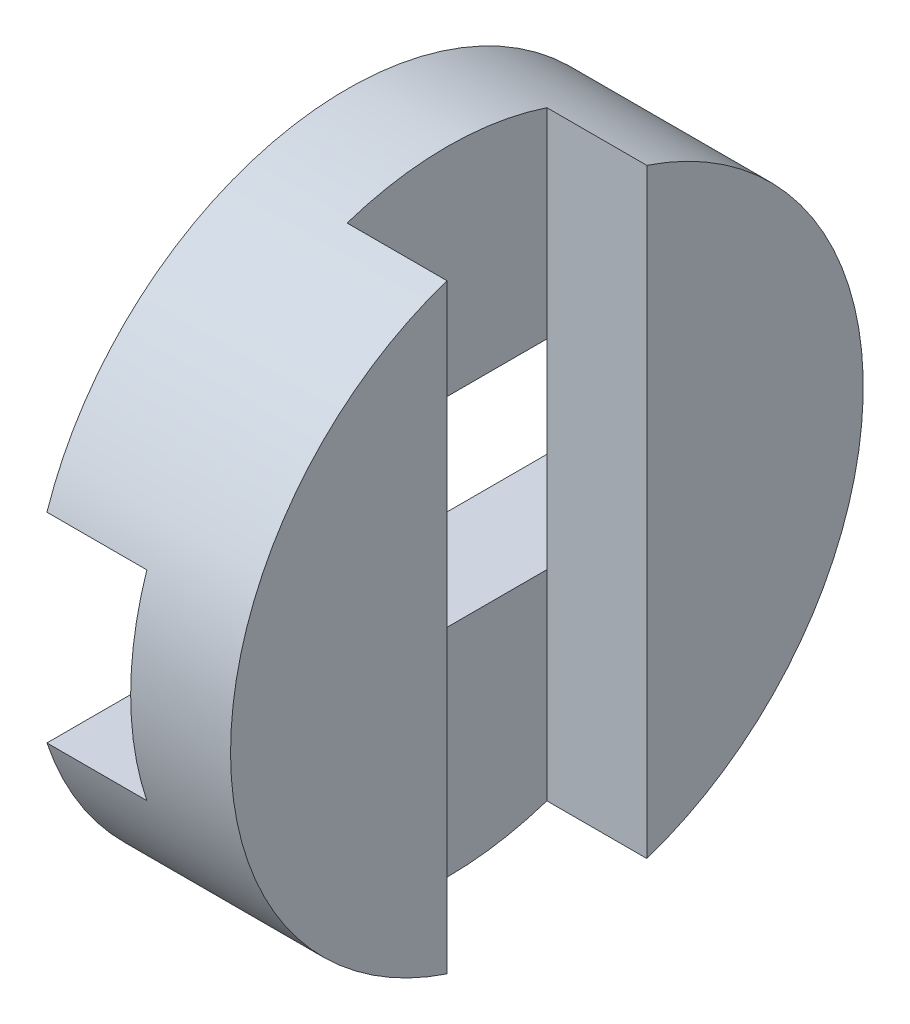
ISO-10303-21;
HEADER;
FILE_DESCRIPTION(('STEP AP214'),'2;1');
FILE_NAME('part.step','',(''),(''),'','','');
FILE_SCHEMA(('AUTOMOTIVE_DESIGN { 1 0 10303 214 1 1 1 1 }'));
ENDSEC;
DATA;
#1=APPLICATION_CONTEXT('core data for automotive mechanical design processes');
#2=APPLICATION_PROTOCOL_DEFINITION('international standard','automotive_design',2000,#1);
#3=PRODUCT_CONTEXT('',#1,'mechanical');
#4=PRODUCT('Part','Part','',(#3));
#5=PRODUCT_RELATED_PRODUCT_CATEGORY('part','',(#4));
#6=PRODUCT_DEFINITION_FORMATION('','',#4);
#7=PRODUCT_DEFINITION_CONTEXT('part definition',#1,'design');
#8=PRODUCT_DEFINITION('design','',#6,#7);
#9=PRODUCT_DEFINITION_SHAPE('','',#8);
#10=(LENGTH_UNIT() NAMED_UNIT(*) SI_UNIT(.MILLI.,.METRE.));
#11=(NAMED_UNIT(*) PLANE_ANGLE_UNIT() SI_UNIT($,.RADIAN.));
#12=(NAMED_UNIT(*) SI_UNIT($,.STERADIAN.) SOLID_ANGLE_UNIT());
#13=UNCERTAINTY_MEASURE_WITH_UNIT(LENGTH_MEASURE(1.E-05),#10,'distance_accuracy_value','');
#14=(GEOMETRIC_REPRESENTATION_CONTEXT(3) GLOBAL_UNCERTAINTY_ASSIGNED_CONTEXT((#13)) GLOBAL_UNIT_ASSIGNED_CONTEXT((#10,
#11,#12)) REPRESENTATION_CONTEXT('',''));
#15=CARTESIAN_POINT('',(0.,0.,0.));
#16=DIRECTION('',(0.,0.,1.));
#17=DIRECTION('',(1.,0.,0.));
#18=AXIS2_PLACEMENT_3D('',#15,#16,#17);
#19=CARTESIAN_POINT('',(6.,0.,0.));
#20=DIRECTION('',(-1.,0.,0.));
#21=DIRECTION('',(0.,0.,1.));
#22=AXIS2_PLACEMENT_3D('',#19,#20,#21);
#23=PLANE('',#22);
#24=CARTESIAN_POINT('',(6.,0.,0.));
#25=DIRECTION('',(-1.,0.,0.));
#26=DIRECTION('',(0.,0.,1.));
#27=AXIS2_PLACEMENT_3D('',#24,#25,#26);
#28=CIRCLE('',#27,9.5);
#29=CARTESIAN_POINT('',(6.,-9.01387818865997,3.));
#30=VERTEX_POINT('',#29);
#31=CARTESIAN_POINT('',(6.,9.01387818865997,3.));
#32=VERTEX_POINT('',#31);
#33=EDGE_CURVE('E143',#30,#32,#28,.T.);
#34=ORIENTED_EDGE('',*,*,#33,.F.);
#35=DIRECTION('',(0.,1.,0.));
#36=VECTOR('',#35,1.);
#37=CARTESIAN_POINT('',(6.,-10.,3.));
#38=LINE('',#37,#36);
#39=EDGE_CURVE('E223',#30,#32,#38,.T.);
#40=ORIENTED_EDGE('',*,*,#39,.T.);
#41=EDGE_LOOP('',(#34,#40));
#42=FACE_BOUND('',#41,.T.);
#43=ADVANCED_FACE('F32',(#42),#23,.F.);
#44=CARTESIAN_POINT('',(3.,3.,-10.));
#45=DIRECTION('',(1.,0.,0.));
#46=DIRECTION('',(0.,0.,-1.));
#47=AXIS2_PLACEMENT_3D('',#44,#45,#46);
#48=PLANE('',#47);
#49=DIRECTION('',(0.,0.,1.));
#50=VECTOR('',#49,1.);
#51=CARTESIAN_POINT('',(3.,3.,-10.));
#52=LINE('',#51,#50);
#53=CARTESIAN_POINT('',(3.,3.,3.));
#54=VERTEX_POINT('',#53);
#55=CARTESIAN_POINT('',(3.,3.,9.01387818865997));
#56=VERTEX_POINT('',#55);
#57=EDGE_CURVE('E147',#54,#56,#52,.T.);
#58=ORIENTED_EDGE('',*,*,#57,.F.);
#59=DIRECTION('',(0.,1.,0.));
#60=VECTOR('',#59,1.);
#61=CARTESIAN_POINT('',(3.,-10.,3.));
#62=LINE('',#61,#60);
#63=CARTESIAN_POINT('',(3.,-3.,3.));
#64=VERTEX_POINT('',#63);
#65=EDGE_CURVE('E184',#64,#54,#62,.T.);
#66=ORIENTED_EDGE('',*,*,#65,.F.);
#67=DIRECTION('',(0.,0.,1.));
#68=VECTOR('',#67,1.);
#69=CARTESIAN_POINT('',(3.,-3.,-10.));
#70=LINE('',#69,#68);
#71=CARTESIAN_POINT('',(3.,-3.,9.01387818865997));
#72=VERTEX_POINT('',#71);
#73=EDGE_CURVE('E152',#64,#72,#70,.T.);
#74=ORIENTED_EDGE('',*,*,#73,.T.);
#75=CARTESIAN_POINT('',(3.,0.,0.));
#76=DIRECTION('',(1.,0.,0.));
#77=DIRECTION('',(0.,0.,-1.));
#78=AXIS2_PLACEMENT_3D('',#75,#76,#77);
#79=CIRCLE('',#78,9.5);
#80=EDGE_CURVE('E40',#56,#72,#79,.T.);
#81=ORIENTED_EDGE('',*,*,#80,.F.);
#82=EDGE_LOOP('',(#58,#66,#74,#81));
#83=FACE_BOUND('',#82,.T.);
#84=ADVANCED_FACE('F179',(#83),#48,.F.);
#85=CARTESIAN_POINT('',(0.,0.,0.));
#86=DIRECTION('',(1.,0.,0.));
#87=DIRECTION('',(0.,0.,-1.));
#88=AXIS2_PLACEMENT_3D('',#85,#86,#87);
#89=PLANE('',#88);
#90=CARTESIAN_POINT('',(0.,0.,0.));
#91=DIRECTION('',(-1.,0.,0.));
#92=DIRECTION('',(0.,0.,1.));
#93=AXIS2_PLACEMENT_3D('',#90,#91,#92);
#94=CIRCLE('',#93,9.5);
#95=CARTESIAN_POINT('',(0.,3.,9.01387818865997));
#96=VERTEX_POINT('',#95);
#97=CARTESIAN_POINT('',(0.,3.,-9.01387818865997));
#98=VERTEX_POINT('',#97);
#99=EDGE_CURVE('E156',#96,#98,#94,.T.);
#100=ORIENTED_EDGE('',*,*,#99,.T.);
#101=DIRECTION('',(0.,0.,1.));
#102=VECTOR('',#101,1.);
#103=CARTESIAN_POINT('',(0.,3.,-10.));
#104=LINE('',#103,#102);
#105=EDGE_CURVE('E140',#98,#96,#104,.T.);
#106=ORIENTED_EDGE('',*,*,#105,.T.);
#107=EDGE_LOOP('',(#100,#106));
#108=FACE_BOUND('',#107,.T.);
#109=ADVANCED_FACE('F196',(#108),#89,.F.);
#110=CARTESIAN_POINT('',(0.,-3.,-9.01387818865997));
#111=VERTEX_POINT('',#110);
#112=CARTESIAN_POINT('',(0.,-3.,9.01387818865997));
#113=VERTEX_POINT('',#112);
#114=EDGE_CURVE('E160',#111,#113,#94,.T.);
#115=ORIENTED_EDGE('',*,*,#114,.T.);
#116=DIRECTION('',(0.,0.,1.));
#117=VECTOR('',#116,1.);
#118=CARTESIAN_POINT('',(0.,-3.,-10.));
#119=LINE('',#118,#117);
#120=EDGE_CURVE('E139',#111,#113,#119,.T.);
#121=ORIENTED_EDGE('',*,*,#120,.F.);
#122=EDGE_LOOP('',(#115,#121));
#123=FACE_BOUND('',#122,.T.);
#124=ADVANCED_FACE('F34',(#123),#89,.F.);
#125=CARTESIAN_POINT('',(0.,0.,0.));
#126=DIRECTION('',(-1.,0.,0.));
#127=DIRECTION('',(0.,0.,1.));
#128=AXIS2_PLACEMENT_3D('',#125,#126,#127);
#129=CYLINDRICAL_SURFACE('',#128,9.5);
#130=ORIENTED_EDGE('',*,*,#99,.F.);
#131=DIRECTION('',(-1.,0.,0.));
#132=VECTOR('',#131,1.);
#133=CARTESIAN_POINT('',(0.,3.,9.01387818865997));
#134=LINE('',#133,#132);
#135=EDGE_CURVE('E11',#96,#56,#134,.F.);
#136=ORIENTED_EDGE('',*,*,#135,.T.);
#137=ORIENTED_EDGE('',*,*,#80,.T.);
#138=DIRECTION('',(-1.,0.,0.));
#139=VECTOR('',#138,1.);
#140=CARTESIAN_POINT('',(0.,-3.,9.01387818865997));
#141=LINE('',#140,#139);
#142=EDGE_CURVE('E168',#72,#113,#141,.T.);
#143=ORIENTED_EDGE('',*,*,#142,.T.);
#144=ORIENTED_EDGE('',*,*,#114,.F.);
#145=DIRECTION('',(-1.,0.,0.));
#146=VECTOR('',#145,1.);
#147=CARTESIAN_POINT('',(0.,-3.,-9.01387818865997));
#148=LINE('',#147,#146);
#149=CARTESIAN_POINT('',(3.,-3.,-9.01387818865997));
#150=VERTEX_POINT('',#149);
#151=EDGE_CURVE('E159',#111,#150,#148,.F.);
#152=ORIENTED_EDGE('',*,*,#151,.T.);
#153=CARTESIAN_POINT('',(3.,3.,-9.01387818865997));
#154=VERTEX_POINT('',#153);
#155=EDGE_CURVE('E163',#150,#154,#79,.T.);
#156=ORIENTED_EDGE('',*,*,#155,.T.);
#157=DIRECTION('',(-1.,0.,0.));
#158=VECTOR('',#157,1.);
#159=CARTESIAN_POINT('',(0.,3.,-9.01387818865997));
#160=LINE('',#159,#158);
#161=EDGE_CURVE('E166',#154,#98,#160,.T.);
#162=ORIENTED_EDGE('',*,*,#161,.T.);
#163=EDGE_LOOP('',(#130,#136,#137,#143,#144,#152,#156,#162));
#164=FACE_BOUND('',#163,.T.);
#165=CARTESIAN_POINT('',(3.,0.,0.));
#166=DIRECTION('',(-1.,0.,0.));
#167=DIRECTION('',(0.,0.,1.));
#168=AXIS2_PLACEMENT_3D('',#165,#166,#167);
#169=CIRCLE('',#168,9.5);
#170=CARTESIAN_POINT('',(3.,-9.01387818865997,-3.));
#171=VERTEX_POINT('',#170);
#172=CARTESIAN_POINT('',(3.,-9.01387818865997,3.));
#173=VERTEX_POINT('',#172);
#174=EDGE_CURVE('E108',#171,#173,#169,.T.);
#175=ORIENTED_EDGE('',*,*,#174,.T.);
#176=DIRECTION('',(-1.,0.,0.));
#177=VECTOR('',#176,1.);
#178=CARTESIAN_POINT('',(0.,-9.01387818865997,3.));
#179=LINE('',#178,#177);
#180=EDGE_CURVE('E130',#173,#30,#179,.F.);
#181=ORIENTED_EDGE('',*,*,#180,.T.);
#182=ORIENTED_EDGE('',*,*,#33,.T.);
#183=DIRECTION('',(-1.,0.,0.));
#184=VECTOR('',#183,1.);
#185=CARTESIAN_POINT('',(0.,9.01387818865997,3.));
#186=LINE('',#185,#184);
#187=CARTESIAN_POINT('',(3.,9.01387818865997,3.));
#188=VERTEX_POINT('',#187);
#189=EDGE_CURVE('E133',#32,#188,#186,.T.);
#190=ORIENTED_EDGE('',*,*,#189,.T.);
#191=CARTESIAN_POINT('',(3.,9.01387818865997,-3.));
#192=VERTEX_POINT('',#191);
#193=EDGE_CURVE('E114',#188,#192,#169,.T.);
#194=ORIENTED_EDGE('',*,*,#193,.T.);
#195=DIRECTION('',(-1.,0.,0.));
#196=VECTOR('',#195,1.);
#197=CARTESIAN_POINT('',(0.,9.01387818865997,-3.));
#198=LINE('',#197,#196);
#199=CARTESIAN_POINT('',(6.,9.01387818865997,-3.));
#200=VERTEX_POINT('',#199);
#201=EDGE_CURVE('E131',#192,#200,#198,.F.);
#202=ORIENTED_EDGE('',*,*,#201,.T.);
#203=CARTESIAN_POINT('',(6.,-9.01387818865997,-3.));
#204=VERTEX_POINT('',#203);
#205=EDGE_CURVE('E129',#200,#204,#28,.T.);
#206=ORIENTED_EDGE('',*,*,#205,.T.);
#207=DIRECTION('',(-1.,0.,0.));
#208=VECTOR('',#207,1.);
#209=CARTESIAN_POINT('',(0.,-9.01387818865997,-3.));
#210=LINE('',#209,#208);
#211=EDGE_CURVE('E47',#204,#171,#210,.T.);
#212=ORIENTED_EDGE('',*,*,#211,.T.);
#213=EDGE_LOOP('',(#175,#181,#182,#190,#194,#202,#206,#212));
#214=FACE_BOUND('',#213,.T.);
#215=ADVANCED_FACE('F126',(#164,#214),#129,.T.);
#216=ORIENTED_EDGE('',*,*,#205,.F.);
#217=DIRECTION('',(0.,1.,0.));
#218=VECTOR('',#217,1.);
#219=CARTESIAN_POINT('',(6.,-10.,-3.));
#220=LINE('',#219,#218);
#221=EDGE_CURVE('E218',#204,#200,#220,.T.);
#222=ORIENTED_EDGE('',*,*,#221,.F.);
#223=EDGE_LOOP('',(#216,#222));
#224=FACE_BOUND('',#223,.T.);
#225=ADVANCED_FACE('F206',(#224),#23,.F.);
#226=CARTESIAN_POINT('',(0.,3.,-10.));
#227=DIRECTION('',(0.,1.,0.));
#228=DIRECTION('',(0.,0.,1.));
#229=AXIS2_PLACEMENT_3D('',#226,#227,#228);
#230=PLANE('',#229);
#231=CARTESIAN_POINT('',(3.,3.,-3.));
#232=VERTEX_POINT('',#231);
#233=EDGE_CURVE('E144',#154,#232,#52,.T.);
#234=ORIENTED_EDGE('',*,*,#233,.T.);
#235=DIRECTION('',(0.,0.,1.));
#236=VECTOR('',#235,1.);
#237=CARTESIAN_POINT('',(3.,3.,-10.));
#238=LINE('',#237,#236);
#239=EDGE_CURVE('E115',#232,#54,#238,.T.);
#240=ORIENTED_EDGE('',*,*,#239,.T.);
#241=ORIENTED_EDGE('',*,*,#57,.T.);
#242=ORIENTED_EDGE('',*,*,#135,.F.);
#243=ORIENTED_EDGE('',*,*,#105,.F.);
#244=ORIENTED_EDGE('',*,*,#161,.F.);
#245=EDGE_LOOP('',(#234,#240,#241,#242,#243,#244));
#246=FACE_BOUND('',#245,.T.);
#247=ADVANCED_FACE('F194',(#246),#230,.F.);
#248=CARTESIAN_POINT('',(3.,-3.,-3.));
#249=VERTEX_POINT('',#248);
#250=EDGE_CURVE('E148',#150,#249,#70,.T.);
#251=ORIENTED_EDGE('',*,*,#250,.T.);
#252=DIRECTION('',(0.,1.,0.));
#253=VECTOR('',#252,1.);
#254=CARTESIAN_POINT('',(3.,-10.,-3.));
#255=LINE('',#254,#253);
#256=EDGE_CURVE('E120',#249,#232,#255,.T.);
#257=ORIENTED_EDGE('',*,*,#256,.T.);
#258=ORIENTED_EDGE('',*,*,#233,.F.);
#259=ORIENTED_EDGE('',*,*,#155,.F.);
#260=EDGE_LOOP('',(#251,#257,#258,#259));
#261=FACE_BOUND('',#260,.T.);
#262=ADVANCED_FACE('F192',(#261),#48,.F.);
#263=CARTESIAN_POINT('',(0.,-3.,-10.));
#264=DIRECTION('',(0.,-1.,0.));
#265=DIRECTION('',(0.,0.,-1.));
#266=AXIS2_PLACEMENT_3D('',#263,#264,#265);
#267=PLANE('',#266);
#268=ORIENTED_EDGE('',*,*,#250,.F.);
#269=ORIENTED_EDGE('',*,*,#151,.F.);
#270=ORIENTED_EDGE('',*,*,#120,.T.);
#271=ORIENTED_EDGE('',*,*,#142,.F.);
#272=ORIENTED_EDGE('',*,*,#73,.F.);
#273=EDGE_CURVE('E151',#249,#64,#70,.T.);
#274=ORIENTED_EDGE('',*,*,#273,.F.);
#275=EDGE_LOOP('',(#268,#269,#270,#271,#272,#274));
#276=FACE_BOUND('',#275,.T.);
#277=ADVANCED_FACE('F186',(#276),#267,.F.);
#278=CARTESIAN_POINT('',(6.,-10.,3.));
#279=DIRECTION('',(0.,0.,1.));
#280=DIRECTION('',(1.,0.,0.));
#281=AXIS2_PLACEMENT_3D('',#278,#279,#280);
#282=PLANE('',#281);
#283=ORIENTED_EDGE('',*,*,#39,.F.);
#284=ORIENTED_EDGE('',*,*,#180,.F.);
#285=EDGE_CURVE('E111',#173,#64,#62,.T.);
#286=ORIENTED_EDGE('',*,*,#285,.T.);
#287=ORIENTED_EDGE('',*,*,#65,.T.);
#288=EDGE_CURVE('E122',#54,#188,#62,.T.);
#289=ORIENTED_EDGE('',*,*,#288,.T.);
#290=ORIENTED_EDGE('',*,*,#189,.F.);
#291=EDGE_LOOP('',(#283,#284,#286,#287,#289,#290));
#292=FACE_BOUND('',#291,.T.);
#293=ADVANCED_FACE('F228',(#292),#282,.F.);
#294=CARTESIAN_POINT('',(6.,-10.,-3.));
#295=DIRECTION('',(0.,0.,-1.));
#296=DIRECTION('',(-1.,0.,0.));
#297=AXIS2_PLACEMENT_3D('',#294,#295,#296);
#298=PLANE('',#297);
#299=ORIENTED_EDGE('',*,*,#221,.T.);
#300=ORIENTED_EDGE('',*,*,#201,.F.);
#301=EDGE_CURVE('E124',#232,#192,#255,.T.);
#302=ORIENTED_EDGE('',*,*,#301,.F.);
#303=ORIENTED_EDGE('',*,*,#256,.F.);
#304=EDGE_CURVE('E54',#171,#249,#255,.T.);
#305=ORIENTED_EDGE('',*,*,#304,.F.);
#306=ORIENTED_EDGE('',*,*,#211,.F.);
#307=EDGE_LOOP('',(#299,#300,#302,#303,#305,#306));
#308=FACE_BOUND('',#307,.T.);
#309=ADVANCED_FACE('F117',(#308),#298,.F.);
#310=CARTESIAN_POINT('',(3.,-10.,-3.));
#311=DIRECTION('',(-1.,0.,0.));
#312=DIRECTION('',(0.,0.,1.));
#313=AXIS2_PLACEMENT_3D('',#310,#311,#312);
#314=PLANE('',#313);
#315=ORIENTED_EDGE('',*,*,#288,.F.);
#316=ORIENTED_EDGE('',*,*,#239,.F.);
#317=ORIENTED_EDGE('',*,*,#301,.T.);
#318=ORIENTED_EDGE('',*,*,#193,.F.);
#319=EDGE_LOOP('',(#315,#316,#317,#318));
#320=FACE_BOUND('',#319,.T.);
#321=ADVANCED_FACE('F231',(#320),#314,.F.);
#322=ORIENTED_EDGE('',*,*,#304,.T.);
#323=ORIENTED_EDGE('',*,*,#273,.T.);
#324=ORIENTED_EDGE('',*,*,#285,.F.);
#325=ORIENTED_EDGE('',*,*,#174,.F.);
#326=EDGE_LOOP('',(#322,#323,#324,#325));
#327=FACE_BOUND('',#326,.T.);
#328=ADVANCED_FACE('F109',(#327),#314,.F.);
#329=CLOSED_SHELL('',(#43,#84,#109,#124,#215,#225,#247,#262,#277,#293,#309,#321,#328));
#330=MANIFOLD_SOLID_BREP('B2',#329);
#331=ADVANCED_BREP_SHAPE_REPRESENTATION('',(#18,#330),#14);
#332=SHAPE_DEFINITION_REPRESENTATION(#9,#331);
ENDSEC;
END-ISO-10303-21;
